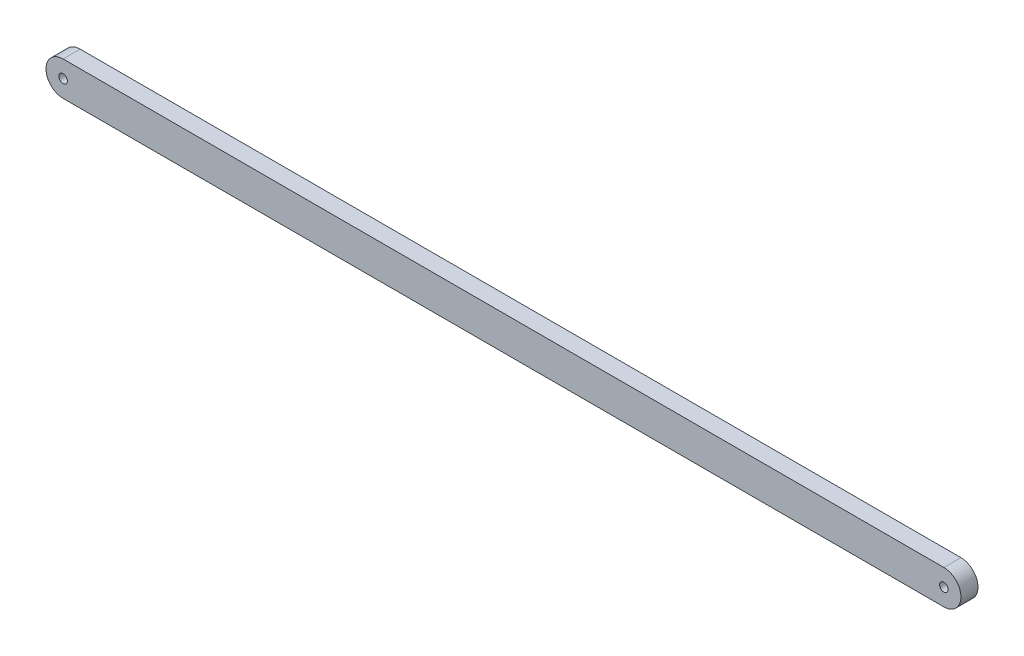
from build123d import *

# Parameters (mm, degrees)
BOSS_EXTRUDE1_DEPTH = 2.54
SKETCH2_R           = 0.635
CUT_EXTRUDE1_DEPTH  = 134.65228025


with BuildPart() as part:
    # Sketch1 → Boss-Extrude1 (new body)
    with BuildSketch(Plane.XY):
        with BuildLine():
            Line((0, 2.54), (131.064, 2.54))
            ThreePointArc((131.064, 2.54), (133.604, 0), (131.064, -2.54))
            Line((131.064, -2.54), (0, -2.54))
            ThreePointArc((0, -2.54), (-2.54, 0), (0, 2.54))
        make_face()
    extrude(amount=BOSS_EXTRUDE1_DEPTH)

    # Sketch2 → Cut-Extrude1 (cut, symmetric)
    with BuildSketch(Plane.XY.offset(2.54)):
        Circle(SKETCH2_R)
    cut_extrude1 = extrude(amount=CUT_EXTRUDE1_DEPTH, both=True, mode=Mode.SUBTRACT)

    # Mirror1: Cut-Extrude1 across plane
    add(cut_extrude1.mirror(Plane(origin=(65.532, 0, 0), x_dir=(0, 0, 1), z_dir=(1, 0, 0))), mode=Mode.SUBTRACT)


solid = part.part
